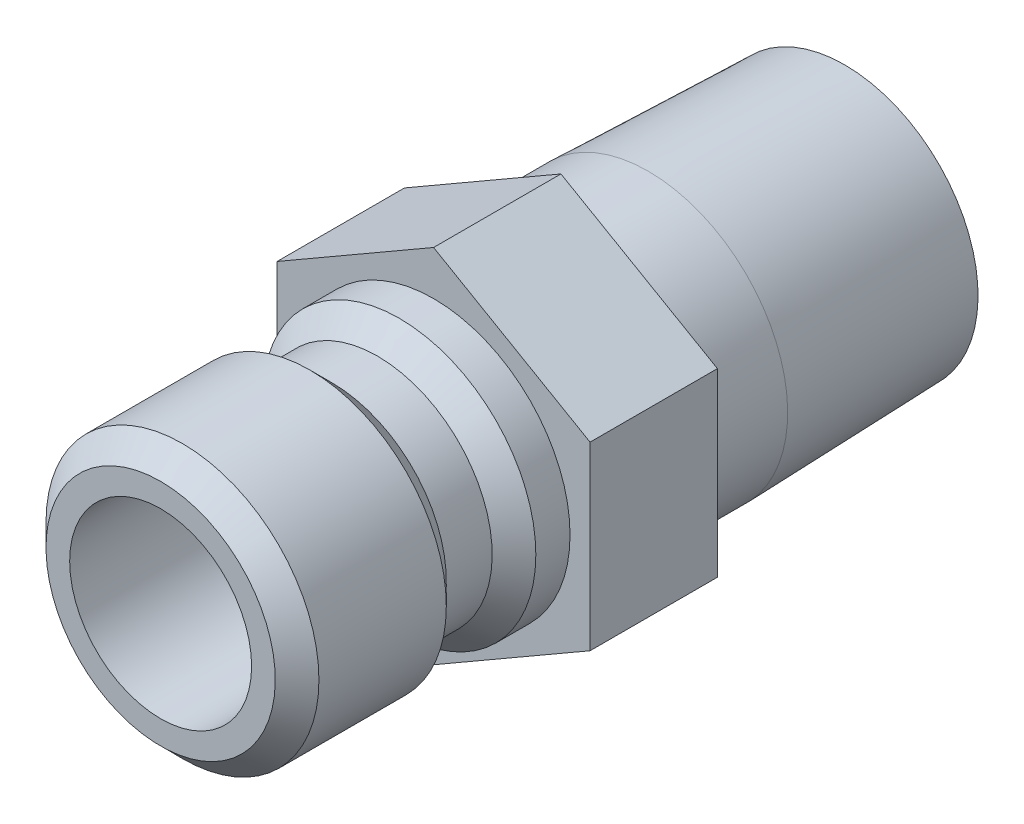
from build123d import *

# Parameters (mm, degrees)
SKETCH2_R           = 3.175
BOSS_EXTRUDE1_DEPTH = 4.445


with BuildPart() as part:
    # Sketch1 → Revolve1 (revolve)
    with BuildSketch(Plane(origin=(0, 0, 0), x_dir=(0, 0, -1), z_dir=(1, 0, 0))):
        Polygon((-9.525, 3.175), (-9.525, 4.0005), (-8.763, 4.7625), (-4.318, 4.7625), (-3.556, 4.0005), (-1.9558, 4.0005), (-1.1938, 4.7625), (0, 4.7625), (0, 4.8641), (7.493, 4.8641), (14.351, 4.649788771), (14.351, 2.9464), (0.127, 2.9464), (0.127, 3.175), align=None)
    revolve(axis=Axis((0, 0, 0), (0, 0, 1)))

    # Sketch2 → Boss-Extrude1 (add)
    with BuildSketch(Plane.XY):
        Polygon((-5.461, 3.15290982), (-5.461, -3.15290982), (0, -6.30581964), (5.461, -3.15290982), (5.461, 3.15290982), (0, 6.30581964), align=None)
        with Locations(Location((0, 0, 0), (0, 0, 90))):
            Circle(SKETCH2_R, mode=Mode.SUBTRACT)
    extrude(amount=-BOSS_EXTRUDE1_DEPTH)


solid = part.part
